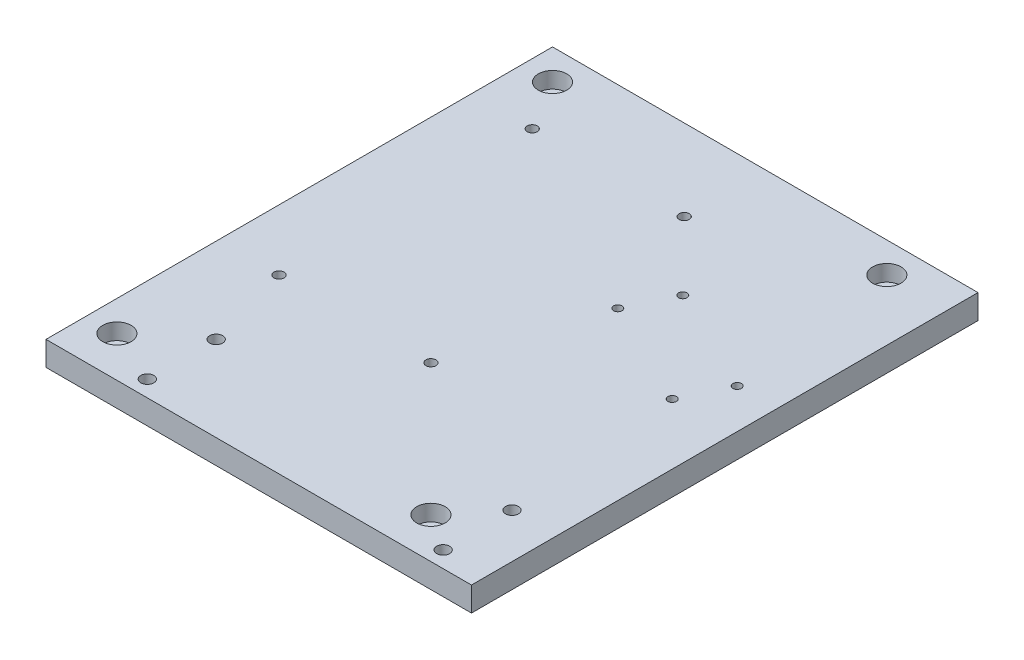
ISO-10303-21;
HEADER;
FILE_DESCRIPTION(('STEP AP214'),'2;1');
FILE_NAME('part.step','',(''),(''),'','','');
FILE_SCHEMA(('AUTOMOTIVE_DESIGN { 1 0 10303 214 1 1 1 1 }'));
ENDSEC;
DATA;
#1=APPLICATION_CONTEXT('core data for automotive mechanical design processes');
#2=APPLICATION_PROTOCOL_DEFINITION('international standard','automotive_design',2000,#1);
#3=PRODUCT_CONTEXT('',#1,'mechanical');
#4=PRODUCT('Part','Part','',(#3));
#5=PRODUCT_RELATED_PRODUCT_CATEGORY('part','',(#4));
#6=PRODUCT_DEFINITION_FORMATION('','',#4);
#7=PRODUCT_DEFINITION_CONTEXT('part definition',#1,'design');
#8=PRODUCT_DEFINITION('design','',#6,#7);
#9=PRODUCT_DEFINITION_SHAPE('','',#8);
#10=(LENGTH_UNIT() NAMED_UNIT(*) SI_UNIT(.MILLI.,.METRE.));
#11=(NAMED_UNIT(*) PLANE_ANGLE_UNIT() SI_UNIT($,.RADIAN.));
#12=(NAMED_UNIT(*) SI_UNIT($,.STERADIAN.) SOLID_ANGLE_UNIT());
#13=UNCERTAINTY_MEASURE_WITH_UNIT(LENGTH_MEASURE(1.E-05),#10,'distance_accuracy_value','');
#14=(GEOMETRIC_REPRESENTATION_CONTEXT(3) GLOBAL_UNCERTAINTY_ASSIGNED_CONTEXT((#13)) GLOBAL_UNIT_ASSIGNED_CONTEXT((#10,
#11,#12)) REPRESENTATION_CONTEXT('',''));
#15=CARTESIAN_POINT('',(0.,0.,0.));
#16=DIRECTION('',(0.,0.,1.));
#17=DIRECTION('',(1.,0.,0.));
#18=AXIS2_PLACEMENT_3D('',#15,#16,#17);
#19=CARTESIAN_POINT('',(-90.,4.,105.));
#20=DIRECTION('',(0.,1.,0.));
#21=DIRECTION('',(0.,0.,1.));
#22=AXIS2_PLACEMENT_3D('',#19,#20,#21);
#23=CYLINDRICAL_SURFACE('',#22,7.00000000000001);
#24=CARTESIAN_POINT('',(-90.,12.,105.));
#25=DIRECTION('',(0.,1.,0.));
#26=DIRECTION('',(0.,0.,1.));
#27=AXIS2_PLACEMENT_3D('',#24,#25,#26);
#28=CIRCLE('',#27,7.00000000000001);
#29=CARTESIAN_POINT('',(-90.,12.,112.));
#30=VERTEX_POINT('',#29);
#31=EDGE_CURVE('E199',#30,#30,#28,.F.);
#32=ORIENTED_EDGE('',*,*,#31,.F.);
#33=EDGE_LOOP('',(#32));
#34=FACE_BOUND('',#33,.T.);
#35=CARTESIAN_POINT('',(-90.,4.,105.));
#36=DIRECTION('',(0.,1.,0.));
#37=DIRECTION('',(0.,0.,1.));
#38=AXIS2_PLACEMENT_3D('',#35,#36,#37);
#39=CIRCLE('',#38,7.00000000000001);
#40=CARTESIAN_POINT('',(-90.,4.,112.));
#41=VERTEX_POINT('',#40);
#42=EDGE_CURVE('E219',#41,#41,#39,.T.);
#43=ORIENTED_EDGE('',*,*,#42,.F.);
#44=EDGE_LOOP('',(#43));
#45=FACE_BOUND('',#44,.T.);
#46=ADVANCED_FACE('F17',(#34,#45),#23,.F.);
#47=CARTESIAN_POINT('',(65.,4.,105.));
#48=DIRECTION('',(0.,1.,0.));
#49=DIRECTION('',(0.,0.,1.));
#50=AXIS2_PLACEMENT_3D('',#47,#48,#49);
#51=CYLINDRICAL_SURFACE('',#50,7.00000000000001);
#52=CARTESIAN_POINT('',(65.,12.,105.));
#53=DIRECTION('',(0.,1.,0.));
#54=DIRECTION('',(0.,0.,1.));
#55=AXIS2_PLACEMENT_3D('',#52,#53,#54);
#56=CIRCLE('',#55,7.00000000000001);
#57=CARTESIAN_POINT('',(65.,12.,112.));
#58=VERTEX_POINT('',#57);
#59=EDGE_CURVE('E196',#58,#58,#56,.F.);
#60=ORIENTED_EDGE('',*,*,#59,.F.);
#61=EDGE_LOOP('',(#60));
#62=FACE_BOUND('',#61,.T.);
#63=CARTESIAN_POINT('',(65.,4.,105.));
#64=DIRECTION('',(0.,1.,0.));
#65=DIRECTION('',(0.,0.,1.));
#66=AXIS2_PLACEMENT_3D('',#63,#64,#65);
#67=CIRCLE('',#66,7.00000000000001);
#68=CARTESIAN_POINT('',(65.,4.,112.));
#69=VERTEX_POINT('',#68);
#70=EDGE_CURVE('E217',#69,#69,#67,.T.);
#71=ORIENTED_EDGE('',*,*,#70,.F.);
#72=EDGE_LOOP('',(#71));
#73=FACE_BOUND('',#72,.T.);
#74=ADVANCED_FACE('F242',(#62,#73),#51,.F.);
#75=CARTESIAN_POINT('',(75.,4.,-110.));
#76=DIRECTION('',(0.,1.,0.));
#77=DIRECTION('',(0.,0.,1.));
#78=AXIS2_PLACEMENT_3D('',#75,#76,#77);
#79=CYLINDRICAL_SURFACE('',#78,7.00000000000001);
#80=CARTESIAN_POINT('',(75.,12.,-110.));
#81=DIRECTION('',(0.,1.,0.));
#82=DIRECTION('',(0.,0.,1.));
#83=AXIS2_PLACEMENT_3D('',#80,#81,#82);
#84=CIRCLE('',#83,7.00000000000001);
#85=CARTESIAN_POINT('',(75.,12.,-103.));
#86=VERTEX_POINT('',#85);
#87=EDGE_CURVE('E193',#86,#86,#84,.F.);
#88=ORIENTED_EDGE('',*,*,#87,.F.);
#89=EDGE_LOOP('',(#88));
#90=FACE_BOUND('',#89,.T.);
#91=CARTESIAN_POINT('',(75.,4.,-110.));
#92=DIRECTION('',(0.,1.,0.));
#93=DIRECTION('',(0.,0.,1.));
#94=AXIS2_PLACEMENT_3D('',#91,#92,#93);
#95=CIRCLE('',#94,7.00000000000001);
#96=CARTESIAN_POINT('',(75.,4.,-103.));
#97=VERTEX_POINT('',#96);
#98=EDGE_CURVE('E214',#97,#97,#95,.T.);
#99=ORIENTED_EDGE('',*,*,#98,.F.);
#100=EDGE_LOOP('',(#99));
#101=FACE_BOUND('',#100,.T.);
#102=ADVANCED_FACE('F231',(#90,#101),#79,.F.);
#103=CARTESIAN_POINT('',(-90.,4.,-110.));
#104=DIRECTION('',(0.,1.,0.));
#105=DIRECTION('',(0.,0.,1.));
#106=AXIS2_PLACEMENT_3D('',#103,#104,#105);
#107=CYLINDRICAL_SURFACE('',#106,7.00000000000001);
#108=CARTESIAN_POINT('',(-90.,12.,-110.));
#109=DIRECTION('',(0.,1.,0.));
#110=DIRECTION('',(0.,0.,1.));
#111=AXIS2_PLACEMENT_3D('',#108,#109,#110);
#112=CIRCLE('',#111,7.00000000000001);
#113=CARTESIAN_POINT('',(-90.,12.,-103.));
#114=VERTEX_POINT('',#113);
#115=EDGE_CURVE('E190',#114,#114,#112,.F.);
#116=ORIENTED_EDGE('',*,*,#115,.F.);
#117=EDGE_LOOP('',(#116));
#118=FACE_BOUND('',#117,.T.);
#119=CARTESIAN_POINT('',(-90.,4.,-110.));
#120=DIRECTION('',(0.,1.,0.));
#121=DIRECTION('',(0.,0.,1.));
#122=AXIS2_PLACEMENT_3D('',#119,#120,#121);
#123=CIRCLE('',#122,7.00000000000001);
#124=CARTESIAN_POINT('',(-90.,4.,-103.));
#125=VERTEX_POINT('',#124);
#126=EDGE_CURVE('E20',#125,#125,#123,.T.);
#127=ORIENTED_EDGE('',*,*,#126,.F.);
#128=EDGE_LOOP('',(#127));
#129=FACE_BOUND('',#128,.T.);
#130=ADVANCED_FACE('F228',(#118,#129),#107,.F.);
#131=CARTESIAN_POINT('',(-63.0000000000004,0.,116.999999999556));
#132=DIRECTION('',(0.,-1.,0.));
#133=DIRECTION('',(0.,0.,-1.));
#134=AXIS2_PLACEMENT_3D('',#131,#132,#133);
#135=CYLINDRICAL_SURFACE('',#134,3.19999999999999);
#136=CARTESIAN_POINT('',(-63.0000000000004,6.8,116.999999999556));
#137=DIRECTION('',(0.,-1.,0.));
#138=DIRECTION('',(0.,0.,-1.));
#139=AXIS2_PLACEMENT_3D('',#136,#137,#138);
#140=CIRCLE('',#139,3.19999999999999);
#141=CARTESIAN_POINT('',(-63.0000000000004,6.8,113.799999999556));
#142=VERTEX_POINT('',#141);
#143=EDGE_CURVE('E211',#142,#142,#140,.T.);
#144=ORIENTED_EDGE('',*,*,#143,.T.);
#145=EDGE_LOOP('',(#144));
#146=FACE_BOUND('',#145,.T.);
#147=CARTESIAN_POINT('',(-63.0000000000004,12.,116.999999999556));
#148=DIRECTION('',(0.,-1.,0.));
#149=DIRECTION('',(0.,0.,-1.));
#150=AXIS2_PLACEMENT_3D('',#147,#148,#149);
#151=CIRCLE('',#150,3.19999999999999);
#152=CARTESIAN_POINT('',(-63.0000000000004,12.,113.799999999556));
#153=VERTEX_POINT('',#152);
#154=EDGE_CURVE('E187',#153,#153,#151,.T.);
#155=ORIENTED_EDGE('',*,*,#154,.F.);
#156=EDGE_LOOP('',(#155));
#157=FACE_BOUND('',#156,.T.);
#158=ADVANCED_FACE('F230',(#146,#157),#135,.F.);
#159=CARTESIAN_POINT('',(-63.0000000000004,0.,82.9999999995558));
#160=DIRECTION('',(0.,-1.,0.));
#161=DIRECTION('',(0.,0.,-1.));
#162=AXIS2_PLACEMENT_3D('',#159,#160,#161);
#163=CYLINDRICAL_SURFACE('',#162,3.19999999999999);
#164=CARTESIAN_POINT('',(-63.0000000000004,6.8,82.9999999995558));
#165=DIRECTION('',(0.,-1.,0.));
#166=DIRECTION('',(0.,0.,-1.));
#167=AXIS2_PLACEMENT_3D('',#164,#165,#166);
#168=CIRCLE('',#167,3.19999999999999);
#169=CARTESIAN_POINT('',(-63.0000000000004,6.8,79.7999999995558));
#170=VERTEX_POINT('',#169);
#171=EDGE_CURVE('E208',#170,#170,#168,.T.);
#172=ORIENTED_EDGE('',*,*,#171,.T.);
#173=EDGE_LOOP('',(#172));
#174=FACE_BOUND('',#173,.T.);
#175=CARTESIAN_POINT('',(-63.0000000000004,12.,82.9999999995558));
#176=DIRECTION('',(0.,-1.,0.));
#177=DIRECTION('',(0.,0.,-1.));
#178=AXIS2_PLACEMENT_3D('',#175,#176,#177);
#179=CIRCLE('',#178,3.19999999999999);
#180=CARTESIAN_POINT('',(-63.0000000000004,12.,79.7999999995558));
#181=VERTEX_POINT('',#180);
#182=EDGE_CURVE('E184',#181,#181,#179,.T.);
#183=ORIENTED_EDGE('',*,*,#182,.F.);
#184=EDGE_LOOP('',(#183));
#185=FACE_BOUND('',#184,.T.);
#186=ADVANCED_FACE('F239',(#174,#185),#163,.F.);
#187=CARTESIAN_POINT('',(82.9999999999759,0.,117.000000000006));
#188=DIRECTION('',(0.,-1.,0.));
#189=DIRECTION('',(0.,0.,-1.));
#190=AXIS2_PLACEMENT_3D('',#187,#188,#189);
#191=CYLINDRICAL_SURFACE('',#190,3.19999999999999);
#192=CARTESIAN_POINT('',(82.9999999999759,6.8,117.000000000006));
#193=DIRECTION('',(0.,-1.,0.));
#194=DIRECTION('',(0.,0.,-1.));
#195=AXIS2_PLACEMENT_3D('',#192,#193,#194);
#196=CIRCLE('',#195,3.19999999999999);
#197=CARTESIAN_POINT('',(82.9999999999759,6.8,113.800000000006));
#198=VERTEX_POINT('',#197);
#199=EDGE_CURVE('E205',#198,#198,#196,.T.);
#200=ORIENTED_EDGE('',*,*,#199,.T.);
#201=EDGE_LOOP('',(#200));
#202=FACE_BOUND('',#201,.T.);
#203=CARTESIAN_POINT('',(82.9999999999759,12.,117.000000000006));
#204=DIRECTION('',(0.,-1.,0.));
#205=DIRECTION('',(0.,0.,-1.));
#206=AXIS2_PLACEMENT_3D('',#203,#204,#205);
#207=CIRCLE('',#206,3.19999999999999);
#208=CARTESIAN_POINT('',(82.9999999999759,12.,113.800000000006));
#209=VERTEX_POINT('',#208);
#210=EDGE_CURVE('E181',#209,#209,#207,.T.);
#211=ORIENTED_EDGE('',*,*,#210,.F.);
#212=EDGE_LOOP('',(#211));
#213=FACE_BOUND('',#212,.T.);
#214=ADVANCED_FACE('F366',(#202,#213),#191,.F.);
#215=CARTESIAN_POINT('',(82.9999999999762,0.,83.0000000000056));
#216=DIRECTION('',(0.,-1.,0.));
#217=DIRECTION('',(0.,0.,-1.));
#218=AXIS2_PLACEMENT_3D('',#215,#216,#217);
#219=CYLINDRICAL_SURFACE('',#218,3.19999999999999);
#220=CARTESIAN_POINT('',(82.9999999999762,6.8,83.0000000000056));
#221=DIRECTION('',(0.,-1.,0.));
#222=DIRECTION('',(0.,0.,-1.));
#223=AXIS2_PLACEMENT_3D('',#220,#221,#222);
#224=CIRCLE('',#223,3.19999999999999);
#225=CARTESIAN_POINT('',(82.9999999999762,6.8,79.8000000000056));
#226=VERTEX_POINT('',#225);
#227=EDGE_CURVE('E202',#226,#226,#224,.T.);
#228=ORIENTED_EDGE('',*,*,#227,.T.);
#229=EDGE_LOOP('',(#228));
#230=FACE_BOUND('',#229,.T.);
#231=CARTESIAN_POINT('',(82.9999999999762,12.,83.0000000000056));
#232=DIRECTION('',(0.,-1.,0.));
#233=DIRECTION('',(0.,0.,-1.));
#234=AXIS2_PLACEMENT_3D('',#231,#232,#233);
#235=CIRCLE('',#234,3.19999999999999);
#236=CARTESIAN_POINT('',(82.9999999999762,12.,79.8000000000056));
#237=VERTEX_POINT('',#236);
#238=EDGE_CURVE('E178',#237,#237,#235,.T.);
#239=ORIENTED_EDGE('',*,*,#238,.F.);
#240=EDGE_LOOP('',(#239));
#241=FACE_BOUND('',#240,.T.);
#242=ADVANCED_FACE('F362',(#230,#241),#219,.F.);
#243=CARTESIAN_POINT('',(-90.,4.,-110.));
#244=DIRECTION('',(0.,1.,0.));
#245=DIRECTION('',(0.,0.,1.));
#246=AXIS2_PLACEMENT_3D('',#243,#244,#245);
#247=PLANE('',#246);
#248=CARTESIAN_POINT('',(-90.,4.,-110.));
#249=DIRECTION('',(0.,1.,0.));
#250=DIRECTION('',(0.,0.,1.));
#251=AXIS2_PLACEMENT_3D('',#248,#249,#250);
#252=CIRCLE('',#251,4.25);
#253=CARTESIAN_POINT('',(-90.,4.,-105.75));
#254=VERTEX_POINT('',#253);
#255=EDGE_CURVE('E175',#254,#254,#252,.F.);
#256=ORIENTED_EDGE('',*,*,#255,.T.);
#257=EDGE_LOOP('',(#256));
#258=FACE_BOUND('',#257,.T.);
#259=ORIENTED_EDGE('',*,*,#126,.T.);
#260=EDGE_LOOP('',(#259));
#261=FACE_BOUND('',#260,.T.);
#262=ADVANCED_FACE('F226',(#258,#261),#247,.T.);
#263=CARTESIAN_POINT('',(-90.,4.,105.));
#264=DIRECTION('',(0.,1.,0.));
#265=DIRECTION('',(0.,0.,1.));
#266=AXIS2_PLACEMENT_3D('',#263,#264,#265);
#267=PLANE('',#266);
#268=CARTESIAN_POINT('',(-90.,4.,105.));
#269=DIRECTION('',(0.,1.,0.));
#270=DIRECTION('',(0.,0.,1.));
#271=AXIS2_PLACEMENT_3D('',#268,#269,#270);
#272=CIRCLE('',#271,4.25);
#273=CARTESIAN_POINT('',(-90.,4.,109.25));
#274=VERTEX_POINT('',#273);
#275=EDGE_CURVE('E172',#274,#274,#272,.F.);
#276=ORIENTED_EDGE('',*,*,#275,.T.);
#277=EDGE_LOOP('',(#276));
#278=FACE_BOUND('',#277,.T.);
#279=ORIENTED_EDGE('',*,*,#42,.T.);
#280=EDGE_LOOP('',(#279));
#281=FACE_BOUND('',#280,.T.);
#282=ADVANCED_FACE('F355',(#278,#281),#267,.T.);
#283=CARTESIAN_POINT('',(65.,4.,105.));
#284=DIRECTION('',(0.,1.,0.));
#285=DIRECTION('',(0.,0.,1.));
#286=AXIS2_PLACEMENT_3D('',#283,#284,#285);
#287=PLANE('',#286);
#288=CARTESIAN_POINT('',(65.,4.,105.));
#289=DIRECTION('',(0.,1.,0.));
#290=DIRECTION('',(0.,0.,1.));
#291=AXIS2_PLACEMENT_3D('',#288,#289,#290);
#292=CIRCLE('',#291,4.25);
#293=CARTESIAN_POINT('',(65.,4.,109.25));
#294=VERTEX_POINT('',#293);
#295=EDGE_CURVE('E169',#294,#294,#292,.F.);
#296=ORIENTED_EDGE('',*,*,#295,.T.);
#297=EDGE_LOOP('',(#296));
#298=FACE_BOUND('',#297,.T.);
#299=ORIENTED_EDGE('',*,*,#70,.T.);
#300=EDGE_LOOP('',(#299));
#301=FACE_BOUND('',#300,.T.);
#302=ADVANCED_FACE('F351',(#298,#301),#287,.T.);
#303=CARTESIAN_POINT('',(75.,4.,-110.));
#304=DIRECTION('',(0.,1.,0.));
#305=DIRECTION('',(0.,0.,1.));
#306=AXIS2_PLACEMENT_3D('',#303,#304,#305);
#307=PLANE('',#306);
#308=CARTESIAN_POINT('',(75.,4.,-110.));
#309=DIRECTION('',(0.,1.,0.));
#310=DIRECTION('',(0.,0.,1.));
#311=AXIS2_PLACEMENT_3D('',#308,#309,#310);
#312=CIRCLE('',#311,4.25);
#313=CARTESIAN_POINT('',(75.,4.,-105.75));
#314=VERTEX_POINT('',#313);
#315=EDGE_CURVE('E166',#314,#314,#312,.F.);
#316=ORIENTED_EDGE('',*,*,#315,.T.);
#317=EDGE_LOOP('',(#316));
#318=FACE_BOUND('',#317,.T.);
#319=ORIENTED_EDGE('',*,*,#98,.T.);
#320=EDGE_LOOP('',(#319));
#321=FACE_BOUND('',#320,.T.);
#322=ADVANCED_FACE('F347',(#318,#321),#307,.T.);
#323=CARTESIAN_POINT('',(-59.8000000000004,6.8,116.999999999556));
#324=DIRECTION('',(0.,1.,0.));
#325=DIRECTION('',(0.,0.,1.));
#326=AXIS2_PLACEMENT_3D('',#323,#324,#325);
#327=PLANE('',#326);
#328=CARTESIAN_POINT('',(-63.0000000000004,6.8,116.999999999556));
#329=DIRECTION('',(0.,-1.,0.));
#330=DIRECTION('',(0.,0.,-1.));
#331=AXIS2_PLACEMENT_3D('',#328,#329,#330);
#332=CIRCLE('',#331,5.50000000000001);
#333=CARTESIAN_POINT('',(-63.0000000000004,6.8,111.499999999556));
#334=VERTEX_POINT('',#333);
#335=EDGE_CURVE('E139',#334,#334,#332,.T.);
#336=ORIENTED_EDGE('',*,*,#335,.T.);
#337=EDGE_LOOP('',(#336));
#338=FACE_BOUND('',#337,.T.);
#339=ORIENTED_EDGE('',*,*,#143,.F.);
#340=EDGE_LOOP('',(#339));
#341=FACE_BOUND('',#340,.T.);
#342=ADVANCED_FACE('F343',(#338,#341),#327,.F.);
#343=CARTESIAN_POINT('',(-59.8000000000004,6.8,82.9999999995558));
#344=DIRECTION('',(0.,1.,0.));
#345=DIRECTION('',(0.,0.,1.));
#346=AXIS2_PLACEMENT_3D('',#343,#344,#345);
#347=PLANE('',#346);
#348=CARTESIAN_POINT('',(-63.0000000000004,6.8,82.9999999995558));
#349=DIRECTION('',(0.,-1.,0.));
#350=DIRECTION('',(0.,0.,-1.));
#351=AXIS2_PLACEMENT_3D('',#348,#349,#350);
#352=CIRCLE('',#351,5.50000000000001);
#353=CARTESIAN_POINT('',(-63.0000000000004,6.8,77.4999999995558));
#354=VERTEX_POINT('',#353);
#355=EDGE_CURVE('E136',#354,#354,#352,.T.);
#356=ORIENTED_EDGE('',*,*,#355,.T.);
#357=EDGE_LOOP('',(#356));
#358=FACE_BOUND('',#357,.T.);
#359=ORIENTED_EDGE('',*,*,#171,.F.);
#360=EDGE_LOOP('',(#359));
#361=FACE_BOUND('',#360,.T.);
#362=ADVANCED_FACE('F339',(#358,#361),#347,.F.);
#363=CARTESIAN_POINT('',(86.1999999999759,6.8,117.000000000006));
#364=DIRECTION('',(0.,1.,0.));
#365=DIRECTION('',(0.,0.,1.));
#366=AXIS2_PLACEMENT_3D('',#363,#364,#365);
#367=PLANE('',#366);
#368=CARTESIAN_POINT('',(82.9999999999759,6.8,117.000000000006));
#369=DIRECTION('',(0.,-1.,0.));
#370=DIRECTION('',(0.,0.,-1.));
#371=AXIS2_PLACEMENT_3D('',#368,#369,#370);
#372=CIRCLE('',#371,5.50000000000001);
#373=CARTESIAN_POINT('',(82.9999999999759,6.8,111.500000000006));
#374=VERTEX_POINT('',#373);
#375=EDGE_CURVE('E133',#374,#374,#372,.T.);
#376=ORIENTED_EDGE('',*,*,#375,.T.);
#377=EDGE_LOOP('',(#376));
#378=FACE_BOUND('',#377,.T.);
#379=ORIENTED_EDGE('',*,*,#199,.F.);
#380=EDGE_LOOP('',(#379));
#381=FACE_BOUND('',#380,.T.);
#382=ADVANCED_FACE('F335',(#378,#381),#367,.F.);
#383=CARTESIAN_POINT('',(86.1999999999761,6.8,83.0000000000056));
#384=DIRECTION('',(0.,1.,0.));
#385=DIRECTION('',(0.,0.,1.));
#386=AXIS2_PLACEMENT_3D('',#383,#384,#385);
#387=PLANE('',#386);
#388=CARTESIAN_POINT('',(82.9999999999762,6.8,83.0000000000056));
#389=DIRECTION('',(0.,-1.,0.));
#390=DIRECTION('',(0.,0.,-1.));
#391=AXIS2_PLACEMENT_3D('',#388,#389,#390);
#392=CIRCLE('',#391,5.50000000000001);
#393=CARTESIAN_POINT('',(82.9999999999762,6.8,77.5000000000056));
#394=VERTEX_POINT('',#393);
#395=EDGE_CURVE('E67',#394,#394,#392,.T.);
#396=ORIENTED_EDGE('',*,*,#395,.T.);
#397=EDGE_LOOP('',(#396));
#398=FACE_BOUND('',#397,.T.);
#399=ORIENTED_EDGE('',*,*,#227,.F.);
#400=EDGE_LOOP('',(#399));
#401=FACE_BOUND('',#400,.T.);
#402=ADVANCED_FACE('F332',(#398,#401),#387,.F.);
#403=CARTESIAN_POINT('',(0.,12.,0.));
#404=DIRECTION('',(0.,1.,0.));
#405=DIRECTION('',(0.,0.,1.));
#406=AXIS2_PLACEMENT_3D('',#403,#404,#405);
#407=PLANE('',#406);
#408=DIRECTION('',(0.,0.,-1.));
#409=VECTOR('',#408,1.);
#410=CARTESIAN_POINT('',(-105.,12.,-125.));
#411=LINE('',#410,#409);
#412=CARTESIAN_POINT('',(-105.,12.,-125.));
#413=VERTEX_POINT('',#412);
#414=CARTESIAN_POINT('',(-105.,12.,125.));
#415=VERTEX_POINT('',#414);
#416=EDGE_CURVE('E55',#413,#415,#411,.F.);
#417=ORIENTED_EDGE('',*,*,#416,.T.);
#418=DIRECTION('',(-1.,0.,0.));
#419=VECTOR('',#418,1.);
#420=CARTESIAN_POINT('',(-105.,12.,125.));
#421=LINE('',#420,#419);
#422=CARTESIAN_POINT('',(105.,12.,125.));
#423=VERTEX_POINT('',#422);
#424=EDGE_CURVE('E756',#415,#423,#421,.F.);
#425=ORIENTED_EDGE('',*,*,#424,.T.);
#426=DIRECTION('',(0.,0.,1.));
#427=VECTOR('',#426,1.);
#428=CARTESIAN_POINT('',(105.,12.,-125.));
#429=LINE('',#428,#427);
#430=CARTESIAN_POINT('',(105.,12.,-125.));
#431=VERTEX_POINT('',#430);
#432=EDGE_CURVE('E61',#423,#431,#429,.F.);
#433=ORIENTED_EDGE('',*,*,#432,.T.);
#434=DIRECTION('',(1.,0.,0.));
#435=VECTOR('',#434,1.);
#436=CARTESIAN_POINT('',(-105.,12.,-125.));
#437=LINE('',#436,#435);
#438=EDGE_CURVE('E58',#431,#413,#437,.F.);
#439=ORIENTED_EDGE('',*,*,#438,.T.);
#440=EDGE_LOOP('',(#417,#425,#433,#439));
#441=FACE_BOUND('',#440,.T.);
#442=ORIENTED_EDGE('',*,*,#238,.T.);
#443=EDGE_LOOP('',(#442));
#444=FACE_BOUND('',#443,.T.);
#445=ORIENTED_EDGE('',*,*,#210,.T.);
#446=EDGE_LOOP('',(#445));
#447=FACE_BOUND('',#446,.T.);
#448=ORIENTED_EDGE('',*,*,#182,.T.);
#449=EDGE_LOOP('',(#448));
#450=FACE_BOUND('',#449,.T.);
#451=ORIENTED_EDGE('',*,*,#154,.T.);
#452=EDGE_LOOP('',(#451));
#453=FACE_BOUND('',#452,.T.);
#454=CARTESIAN_POINT('',(75.0074574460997,12.,-4.04729389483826));
#455=DIRECTION('',(0.,1.,0.));
#456=DIRECTION('',(0.,0.,1.));
#457=AXIS2_PLACEMENT_3D('',#454,#455,#456);
#458=CIRCLE('',#457,2.09999999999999);
#459=CARTESIAN_POINT('',(75.0074574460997,12.,-1.94729389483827));
#460=VERTEX_POINT('',#459);
#461=EDGE_CURVE('E142',#460,#460,#458,.F.);
#462=ORIENTED_EDGE('',*,*,#461,.T.);
#463=EDGE_LOOP('',(#462));
#464=FACE_BOUND('',#463,.T.);
#465=CARTESIAN_POINT('',(85.4891263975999,12.,-25.637444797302));
#466=DIRECTION('',(0.,1.,0.));
#467=DIRECTION('',(0.,0.,1.));
#468=AXIS2_PLACEMENT_3D('',#465,#466,#467);
#469=CIRCLE('',#468,2.09999999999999);
#470=CARTESIAN_POINT('',(85.4891263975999,12.,-23.537444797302));
#471=VERTEX_POINT('',#470);
#472=EDGE_CURVE('E145',#471,#471,#469,.F.);
#473=ORIENTED_EDGE('',*,*,#472,.T.);
#474=EDGE_LOOP('',(#473));
#475=FACE_BOUND('',#474,.T.);
#476=CARTESIAN_POINT('',(22.8312594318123,12.,-29.3779938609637));
#477=DIRECTION('',(0.,1.,0.));
#478=DIRECTION('',(0.,0.,1.));
#479=AXIS2_PLACEMENT_3D('',#476,#477,#478);
#480=CIRCLE('',#479,2.09999999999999);
#481=CARTESIAN_POINT('',(22.8312594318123,12.,-27.2779938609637));
#482=VERTEX_POINT('',#481);
#483=EDGE_CURVE('E148',#482,#482,#480,.F.);
#484=ORIENTED_EDGE('',*,*,#483,.T.);
#485=EDGE_LOOP('',(#484));
#486=FACE_BOUND('',#485,.T.);
#487=CARTESIAN_POINT('',(33.3129283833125,12.,-50.9681447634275));
#488=DIRECTION('',(0.,1.,0.));
#489=DIRECTION('',(0.,0.,1.));
#490=AXIS2_PLACEMENT_3D('',#487,#488,#489);
#491=CIRCLE('',#490,2.09999999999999);
#492=CARTESIAN_POINT('',(33.3129283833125,12.,-48.8681447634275));
#493=VERTEX_POINT('',#492);
#494=EDGE_CURVE('E151',#493,#493,#491,.F.);
#495=ORIENTED_EDGE('',*,*,#494,.T.);
#496=EDGE_LOOP('',(#495));
#497=FACE_BOUND('',#496,.T.);
#498=CARTESIAN_POINT('',(-74.9999999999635,12.,39.9999999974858));
#499=DIRECTION('',(0.,1.,0.));
#500=DIRECTION('',(0.,0.,1.));
#501=AXIS2_PLACEMENT_3D('',#498,#499,#500);
#502=CIRCLE('',#501,2.5);
#503=CARTESIAN_POINT('',(-74.9999999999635,12.,42.4999999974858));
#504=VERTEX_POINT('',#503);
#505=EDGE_CURVE('E154',#504,#504,#502,.F.);
#506=ORIENTED_EDGE('',*,*,#505,.T.);
#507=EDGE_LOOP('',(#506));
#508=FACE_BOUND('',#507,.T.);
#509=CARTESIAN_POINT('',(3.64708263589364E-11,12.,39.9999999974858));
#510=DIRECTION('',(0.,1.,0.));
#511=DIRECTION('',(0.,0.,1.));
#512=AXIS2_PLACEMENT_3D('',#509,#510,#511);
#513=CIRCLE('',#512,2.5);
#514=CARTESIAN_POINT('',(3.64708263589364E-11,12.,42.4999999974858));
#515=VERTEX_POINT('',#514);
#516=EDGE_CURVE('E157',#515,#515,#513,.F.);
#517=ORIENTED_EDGE('',*,*,#516,.T.);
#518=EDGE_LOOP('',(#517));
#519=FACE_BOUND('',#518,.T.);
#520=CARTESIAN_POINT('',(-74.9999999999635,12.,-85.0000000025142));
#521=DIRECTION('',(0.,1.,0.));
#522=DIRECTION('',(0.,0.,1.));
#523=AXIS2_PLACEMENT_3D('',#520,#521,#522);
#524=CIRCLE('',#523,2.5);
#525=CARTESIAN_POINT('',(-74.9999999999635,12.,-82.5000000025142));
#526=VERTEX_POINT('',#525);
#527=EDGE_CURVE('E160',#526,#526,#524,.F.);
#528=ORIENTED_EDGE('',*,*,#527,.T.);
#529=EDGE_LOOP('',(#528));
#530=FACE_BOUND('',#529,.T.);
#531=CARTESIAN_POINT('',(3.64708263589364E-11,12.,-85.0000000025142));
#532=DIRECTION('',(0.,1.,0.));
#533=DIRECTION('',(0.,0.,1.));
#534=AXIS2_PLACEMENT_3D('',#531,#532,#533);
#535=CIRCLE('',#534,2.5);
#536=CARTESIAN_POINT('',(3.64708263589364E-11,12.,-82.5000000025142));
#537=VERTEX_POINT('',#536);
#538=EDGE_CURVE('E163',#537,#537,#535,.F.);
#539=ORIENTED_EDGE('',*,*,#538,.T.);
#540=EDGE_LOOP('',(#539));
#541=FACE_BOUND('',#540,.T.);
#542=ORIENTED_EDGE('',*,*,#115,.T.);
#543=EDGE_LOOP('',(#542));
#544=FACE_BOUND('',#543,.T.);
#545=ORIENTED_EDGE('',*,*,#87,.T.);
#546=EDGE_LOOP('',(#545));
#547=FACE_BOUND('',#546,.T.);
#548=ORIENTED_EDGE('',*,*,#59,.T.);
#549=EDGE_LOOP('',(#548));
#550=FACE_BOUND('',#549,.T.);
#551=ORIENTED_EDGE('',*,*,#31,.T.);
#552=EDGE_LOOP('',(#551));
#553=FACE_BOUND('',#552,.T.);
#554=ADVANCED_FACE('F59',(#441,#444,#447,#450,#453,#464,#475,#486,#497,#508,#519,#530,#541,#544,
#547,#550,#553),#407,.T.);
#555=CARTESIAN_POINT('',(-90.,0.,-110.));
#556=DIRECTION('',(0.,1.,0.));
#557=DIRECTION('',(0.,0.,1.));
#558=AXIS2_PLACEMENT_3D('',#555,#556,#557);
#559=CYLINDRICAL_SURFACE('',#558,4.25);
#560=CARTESIAN_POINT('',(-90.,0.,-110.));
#561=DIRECTION('',(0.,1.,0.));
#562=DIRECTION('',(0.,0.,1.));
#563=AXIS2_PLACEMENT_3D('',#560,#561,#562);
#564=CIRCLE('',#563,4.25);
#565=CARTESIAN_POINT('',(-90.,0.,-105.75));
#566=VERTEX_POINT('',#565);
#567=EDGE_CURVE('E127',#566,#566,#564,.F.);
#568=ORIENTED_EDGE('',*,*,#567,.T.);
#569=EDGE_LOOP('',(#568));
#570=FACE_BOUND('',#569,.T.);
#571=ORIENTED_EDGE('',*,*,#255,.F.);
#572=EDGE_LOOP('',(#571));
#573=FACE_BOUND('',#572,.T.);
#574=ADVANCED_FACE('F325',(#570,#573),#559,.F.);
#575=CARTESIAN_POINT('',(-90.,0.,105.));
#576=DIRECTION('',(0.,1.,0.));
#577=DIRECTION('',(0.,0.,1.));
#578=AXIS2_PLACEMENT_3D('',#575,#576,#577);
#579=CYLINDRICAL_SURFACE('',#578,4.25);
#580=CARTESIAN_POINT('',(-90.,0.,105.));
#581=DIRECTION('',(0.,1.,0.));
#582=DIRECTION('',(0.,0.,1.));
#583=AXIS2_PLACEMENT_3D('',#580,#581,#582);
#584=CIRCLE('',#583,4.25);
#585=CARTESIAN_POINT('',(-90.,0.,109.25));
#586=VERTEX_POINT('',#585);
#587=EDGE_CURVE('E124',#586,#586,#584,.F.);
#588=ORIENTED_EDGE('',*,*,#587,.T.);
#589=EDGE_LOOP('',(#588));
#590=FACE_BOUND('',#589,.T.);
#591=ORIENTED_EDGE('',*,*,#275,.F.);
#592=EDGE_LOOP('',(#591));
#593=FACE_BOUND('',#592,.T.);
#594=ADVANCED_FACE('F321',(#590,#593),#579,.F.);
#595=CARTESIAN_POINT('',(65.,0.,105.));
#596=DIRECTION('',(0.,1.,0.));
#597=DIRECTION('',(0.,0.,1.));
#598=AXIS2_PLACEMENT_3D('',#595,#596,#597);
#599=CYLINDRICAL_SURFACE('',#598,4.25);
#600=CARTESIAN_POINT('',(65.,0.,105.));
#601=DIRECTION('',(0.,1.,0.));
#602=DIRECTION('',(0.,0.,1.));
#603=AXIS2_PLACEMENT_3D('',#600,#601,#602);
#604=CIRCLE('',#603,4.25);
#605=CARTESIAN_POINT('',(65.,0.,109.25));
#606=VERTEX_POINT('',#605);
#607=EDGE_CURVE('E121',#606,#606,#604,.F.);
#608=ORIENTED_EDGE('',*,*,#607,.T.);
#609=EDGE_LOOP('',(#608));
#610=FACE_BOUND('',#609,.T.);
#611=ORIENTED_EDGE('',*,*,#295,.F.);
#612=EDGE_LOOP('',(#611));
#613=FACE_BOUND('',#612,.T.);
#614=ADVANCED_FACE('F317',(#610,#613),#599,.F.);
#615=CARTESIAN_POINT('',(75.,0.,-110.));
#616=DIRECTION('',(0.,1.,0.));
#617=DIRECTION('',(0.,0.,1.));
#618=AXIS2_PLACEMENT_3D('',#615,#616,#617);
#619=CYLINDRICAL_SURFACE('',#618,4.25);
#620=CARTESIAN_POINT('',(75.,0.,-110.));
#621=DIRECTION('',(0.,1.,0.));
#622=DIRECTION('',(0.,0.,1.));
#623=AXIS2_PLACEMENT_3D('',#620,#621,#622);
#624=CIRCLE('',#623,4.25);
#625=CARTESIAN_POINT('',(75.,0.,-105.75));
#626=VERTEX_POINT('',#625);
#627=EDGE_CURVE('E118',#626,#626,#624,.F.);
#628=ORIENTED_EDGE('',*,*,#627,.T.);
#629=EDGE_LOOP('',(#628));
#630=FACE_BOUND('',#629,.T.);
#631=ORIENTED_EDGE('',*,*,#315,.F.);
#632=EDGE_LOOP('',(#631));
#633=FACE_BOUND('',#632,.T.);
#634=ADVANCED_FACE('F313',(#630,#633),#619,.F.);
#635=CARTESIAN_POINT('',(3.64708263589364E-11,12.,-85.0000000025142));
#636=DIRECTION('',(0.,1.,0.));
#637=DIRECTION('',(0.,0.,1.));
#638=AXIS2_PLACEMENT_3D('',#635,#636,#637);
#639=CYLINDRICAL_SURFACE('',#638,2.5);
#640=CARTESIAN_POINT('',(3.64708263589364E-11,0.,-85.0000000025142));
#641=DIRECTION('',(0.,1.,0.));
#642=DIRECTION('',(0.,0.,1.));
#643=AXIS2_PLACEMENT_3D('',#640,#641,#642);
#644=CIRCLE('',#643,2.5);
#645=CARTESIAN_POINT('',(3.64708263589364E-11,0.,-82.5000000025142));
#646=VERTEX_POINT('',#645);
#647=EDGE_CURVE('E115',#646,#646,#644,.F.);
#648=ORIENTED_EDGE('',*,*,#647,.T.);
#649=EDGE_LOOP('',(#648));
#650=FACE_BOUND('',#649,.T.);
#651=ORIENTED_EDGE('',*,*,#538,.F.);
#652=EDGE_LOOP('',(#651));
#653=FACE_BOUND('',#652,.T.);
#654=ADVANCED_FACE('F309',(#650,#653),#639,.F.);
#655=CARTESIAN_POINT('',(-74.9999999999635,12.,-85.0000000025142));
#656=DIRECTION('',(0.,1.,0.));
#657=DIRECTION('',(0.,0.,1.));
#658=AXIS2_PLACEMENT_3D('',#655,#656,#657);
#659=CYLINDRICAL_SURFACE('',#658,2.5);
#660=CARTESIAN_POINT('',(-74.9999999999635,0.,-85.0000000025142));
#661=DIRECTION('',(0.,1.,0.));
#662=DIRECTION('',(0.,0.,1.));
#663=AXIS2_PLACEMENT_3D('',#660,#661,#662);
#664=CIRCLE('',#663,2.5);
#665=CARTESIAN_POINT('',(-74.9999999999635,0.,-82.5000000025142));
#666=VERTEX_POINT('',#665);
#667=EDGE_CURVE('E112',#666,#666,#664,.F.);
#668=ORIENTED_EDGE('',*,*,#667,.T.);
#669=EDGE_LOOP('',(#668));
#670=FACE_BOUND('',#669,.T.);
#671=ORIENTED_EDGE('',*,*,#527,.F.);
#672=EDGE_LOOP('',(#671));
#673=FACE_BOUND('',#672,.T.);
#674=ADVANCED_FACE('F305',(#670,#673),#659,.F.);
#675=CARTESIAN_POINT('',(3.64708263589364E-11,12.,39.9999999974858));
#676=DIRECTION('',(0.,1.,0.));
#677=DIRECTION('',(0.,0.,1.));
#678=AXIS2_PLACEMENT_3D('',#675,#676,#677);
#679=CYLINDRICAL_SURFACE('',#678,2.5);
#680=CARTESIAN_POINT('',(3.64708263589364E-11,0.,39.9999999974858));
#681=DIRECTION('',(0.,1.,0.));
#682=DIRECTION('',(0.,0.,1.));
#683=AXIS2_PLACEMENT_3D('',#680,#681,#682);
#684=CIRCLE('',#683,2.5);
#685=CARTESIAN_POINT('',(3.64708263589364E-11,0.,42.4999999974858));
#686=VERTEX_POINT('',#685);
#687=EDGE_CURVE('E109',#686,#686,#684,.F.);
#688=ORIENTED_EDGE('',*,*,#687,.T.);
#689=EDGE_LOOP('',(#688));
#690=FACE_BOUND('',#689,.T.);
#691=ORIENTED_EDGE('',*,*,#516,.F.);
#692=EDGE_LOOP('',(#691));
#693=FACE_BOUND('',#692,.T.);
#694=ADVANCED_FACE('F301',(#690,#693),#679,.F.);
#695=CARTESIAN_POINT('',(-74.9999999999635,12.,39.9999999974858));
#696=DIRECTION('',(0.,1.,0.));
#697=DIRECTION('',(0.,0.,1.));
#698=AXIS2_PLACEMENT_3D('',#695,#696,#697);
#699=CYLINDRICAL_SURFACE('',#698,2.5);
#700=CARTESIAN_POINT('',(-74.9999999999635,0.,39.9999999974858));
#701=DIRECTION('',(0.,1.,0.));
#702=DIRECTION('',(0.,0.,1.));
#703=AXIS2_PLACEMENT_3D('',#700,#701,#702);
#704=CIRCLE('',#703,2.5);
#705=CARTESIAN_POINT('',(-74.9999999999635,0.,42.4999999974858));
#706=VERTEX_POINT('',#705);
#707=EDGE_CURVE('E106',#706,#706,#704,.F.);
#708=ORIENTED_EDGE('',*,*,#707,.T.);
#709=EDGE_LOOP('',(#708));
#710=FACE_BOUND('',#709,.T.);
#711=ORIENTED_EDGE('',*,*,#505,.F.);
#712=EDGE_LOOP('',(#711));
#713=FACE_BOUND('',#712,.T.);
#714=ADVANCED_FACE('F297',(#710,#713),#699,.F.);
#715=CARTESIAN_POINT('',(33.3129283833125,12.,-50.9681447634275));
#716=DIRECTION('',(0.,1.,0.));
#717=DIRECTION('',(0.,0.,1.));
#718=AXIS2_PLACEMENT_3D('',#715,#716,#717);
#719=CYLINDRICAL_SURFACE('',#718,2.09999999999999);
#720=CARTESIAN_POINT('',(33.3129283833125,0.,-50.9681447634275));
#721=DIRECTION('',(0.,1.,0.));
#722=DIRECTION('',(0.,0.,1.));
#723=AXIS2_PLACEMENT_3D('',#720,#721,#722);
#724=CIRCLE('',#723,2.09999999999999);
#725=CARTESIAN_POINT('',(33.3129283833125,0.,-48.8681447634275));
#726=VERTEX_POINT('',#725);
#727=EDGE_CURVE('E103',#726,#726,#724,.F.);
#728=ORIENTED_EDGE('',*,*,#727,.T.);
#729=EDGE_LOOP('',(#728));
#730=FACE_BOUND('',#729,.T.);
#731=ORIENTED_EDGE('',*,*,#494,.F.);
#732=EDGE_LOOP('',(#731));
#733=FACE_BOUND('',#732,.T.);
#734=ADVANCED_FACE('F293',(#730,#733),#719,.F.);
#735=CARTESIAN_POINT('',(22.8312594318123,12.,-29.3779938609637));
#736=DIRECTION('',(0.,1.,0.));
#737=DIRECTION('',(0.,0.,1.));
#738=AXIS2_PLACEMENT_3D('',#735,#736,#737);
#739=CYLINDRICAL_SURFACE('',#738,2.09999999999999);
#740=CARTESIAN_POINT('',(22.8312594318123,0.,-29.3779938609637));
#741=DIRECTION('',(0.,1.,0.));
#742=DIRECTION('',(0.,0.,1.));
#743=AXIS2_PLACEMENT_3D('',#740,#741,#742);
#744=CIRCLE('',#743,2.09999999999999);
#745=CARTESIAN_POINT('',(22.8312594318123,0.,-27.2779938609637));
#746=VERTEX_POINT('',#745);
#747=EDGE_CURVE('E100',#746,#746,#744,.F.);
#748=ORIENTED_EDGE('',*,*,#747,.T.);
#749=EDGE_LOOP('',(#748));
#750=FACE_BOUND('',#749,.T.);
#751=ORIENTED_EDGE('',*,*,#483,.F.);
#752=EDGE_LOOP('',(#751));
#753=FACE_BOUND('',#752,.T.);
#754=ADVANCED_FACE('F289',(#750,#753),#739,.F.);
#755=CARTESIAN_POINT('',(85.4891263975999,12.,-25.637444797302));
#756=DIRECTION('',(0.,1.,0.));
#757=DIRECTION('',(0.,0.,1.));
#758=AXIS2_PLACEMENT_3D('',#755,#756,#757);
#759=CYLINDRICAL_SURFACE('',#758,2.09999999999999);
#760=CARTESIAN_POINT('',(85.4891263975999,0.,-25.637444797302));
#761=DIRECTION('',(0.,1.,0.));
#762=DIRECTION('',(0.,0.,1.));
#763=AXIS2_PLACEMENT_3D('',#760,#761,#762);
#764=CIRCLE('',#763,2.09999999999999);
#765=CARTESIAN_POINT('',(85.4891263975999,0.,-23.537444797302));
#766=VERTEX_POINT('',#765);
#767=EDGE_CURVE('E97',#766,#766,#764,.F.);
#768=ORIENTED_EDGE('',*,*,#767,.T.);
#769=EDGE_LOOP('',(#768));
#770=FACE_BOUND('',#769,.T.);
#771=ORIENTED_EDGE('',*,*,#472,.F.);
#772=EDGE_LOOP('',(#771));
#773=FACE_BOUND('',#772,.T.);
#774=ADVANCED_FACE('F285',(#770,#773),#759,.F.);
#775=CARTESIAN_POINT('',(75.0074574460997,12.,-4.04729389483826));
#776=DIRECTION('',(0.,1.,0.));
#777=DIRECTION('',(0.,0.,1.));
#778=AXIS2_PLACEMENT_3D('',#775,#776,#777);
#779=CYLINDRICAL_SURFACE('',#778,2.09999999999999);
#780=CARTESIAN_POINT('',(75.0074574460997,0.,-4.04729389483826));
#781=DIRECTION('',(0.,1.,0.));
#782=DIRECTION('',(0.,0.,1.));
#783=AXIS2_PLACEMENT_3D('',#780,#781,#782);
#784=CIRCLE('',#783,2.09999999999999);
#785=CARTESIAN_POINT('',(75.0074574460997,0.,-1.94729389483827));
#786=VERTEX_POINT('',#785);
#787=EDGE_CURVE('E94',#786,#786,#784,.F.);
#788=ORIENTED_EDGE('',*,*,#787,.T.);
#789=EDGE_LOOP('',(#788));
#790=FACE_BOUND('',#789,.T.);
#791=ORIENTED_EDGE('',*,*,#461,.F.);
#792=EDGE_LOOP('',(#791));
#793=FACE_BOUND('',#792,.T.);
#794=ADVANCED_FACE('F281',(#790,#793),#779,.F.);
#795=CARTESIAN_POINT('',(-63.0000000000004,0.,116.999999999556));
#796=DIRECTION('',(0.,-1.,0.));
#797=DIRECTION('',(0.,0.,-1.));
#798=AXIS2_PLACEMENT_3D('',#795,#796,#797);
#799=CYLINDRICAL_SURFACE('',#798,5.50000000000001);
#800=ORIENTED_EDGE('',*,*,#335,.F.);
#801=EDGE_LOOP('',(#800));
#802=FACE_BOUND('',#801,.T.);
#803=CARTESIAN_POINT('',(-63.0000000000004,0.,116.999999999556));
#804=DIRECTION('',(0.,-1.,0.));
#805=DIRECTION('',(0.,0.,-1.));
#806=AXIS2_PLACEMENT_3D('',#803,#804,#805);
#807=CIRCLE('',#806,5.50000000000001);
#808=CARTESIAN_POINT('',(-63.0000000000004,0.,111.499999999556));
#809=VERTEX_POINT('',#808);
#810=EDGE_CURVE('E91',#809,#809,#807,.T.);
#811=ORIENTED_EDGE('',*,*,#810,.T.);
#812=EDGE_LOOP('',(#811));
#813=FACE_BOUND('',#812,.T.);
#814=ADVANCED_FACE('F277',(#802,#813),#799,.F.);
#815=CARTESIAN_POINT('',(-63.0000000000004,0.,82.9999999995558));
#816=DIRECTION('',(0.,-1.,0.));
#817=DIRECTION('',(0.,0.,-1.));
#818=AXIS2_PLACEMENT_3D('',#815,#816,#817);
#819=CYLINDRICAL_SURFACE('',#818,5.50000000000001);
#820=ORIENTED_EDGE('',*,*,#355,.F.);
#821=EDGE_LOOP('',(#820));
#822=FACE_BOUND('',#821,.T.);
#823=CARTESIAN_POINT('',(-63.0000000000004,0.,82.9999999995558));
#824=DIRECTION('',(0.,-1.,0.));
#825=DIRECTION('',(0.,0.,-1.));
#826=AXIS2_PLACEMENT_3D('',#823,#824,#825);
#827=CIRCLE('',#826,5.50000000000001);
#828=CARTESIAN_POINT('',(-63.0000000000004,0.,77.4999999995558));
#829=VERTEX_POINT('',#828);
#830=EDGE_CURVE('E88',#829,#829,#827,.T.);
#831=ORIENTED_EDGE('',*,*,#830,.T.);
#832=EDGE_LOOP('',(#831));
#833=FACE_BOUND('',#832,.T.);
#834=ADVANCED_FACE('F273',(#822,#833),#819,.F.);
#835=CARTESIAN_POINT('',(82.9999999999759,0.,117.000000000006));
#836=DIRECTION('',(0.,-1.,0.));
#837=DIRECTION('',(0.,0.,-1.));
#838=AXIS2_PLACEMENT_3D('',#835,#836,#837);
#839=CYLINDRICAL_SURFACE('',#838,5.50000000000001);
#840=ORIENTED_EDGE('',*,*,#375,.F.);
#841=EDGE_LOOP('',(#840));
#842=FACE_BOUND('',#841,.T.);
#843=CARTESIAN_POINT('',(82.9999999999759,0.,117.000000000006));
#844=DIRECTION('',(0.,-1.,0.));
#845=DIRECTION('',(0.,0.,-1.));
#846=AXIS2_PLACEMENT_3D('',#843,#844,#845);
#847=CIRCLE('',#846,5.50000000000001);
#848=CARTESIAN_POINT('',(82.9999999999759,0.,111.500000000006));
#849=VERTEX_POINT('',#848);
#850=EDGE_CURVE('E85',#849,#849,#847,.T.);
#851=ORIENTED_EDGE('',*,*,#850,.T.);
#852=EDGE_LOOP('',(#851));
#853=FACE_BOUND('',#852,.T.);
#854=ADVANCED_FACE('F269',(#842,#853),#839,.F.);
#855=CARTESIAN_POINT('',(82.9999999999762,0.,83.0000000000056));
#856=DIRECTION('',(0.,-1.,0.));
#857=DIRECTION('',(0.,0.,-1.));
#858=AXIS2_PLACEMENT_3D('',#855,#856,#857);
#859=CYLINDRICAL_SURFACE('',#858,5.50000000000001);
#860=ORIENTED_EDGE('',*,*,#395,.F.);
#861=EDGE_LOOP('',(#860));
#862=FACE_BOUND('',#861,.T.);
#863=CARTESIAN_POINT('',(82.9999999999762,0.,83.0000000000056));
#864=DIRECTION('',(0.,-1.,0.));
#865=DIRECTION('',(0.,0.,-1.));
#866=AXIS2_PLACEMENT_3D('',#863,#864,#865);
#867=CIRCLE('',#866,5.50000000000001);
#868=CARTESIAN_POINT('',(82.9999999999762,0.,77.5000000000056));
#869=VERTEX_POINT('',#868);
#870=EDGE_CURVE('E82',#869,#869,#867,.T.);
#871=ORIENTED_EDGE('',*,*,#870,.T.);
#872=EDGE_LOOP('',(#871));
#873=FACE_BOUND('',#872,.T.);
#874=ADVANCED_FACE('F266',(#862,#873),#859,.F.);
#875=CARTESIAN_POINT('',(-105.,12.,-125.));
#876=DIRECTION('',(0.,0.,1.));
#877=DIRECTION('',(1.,0.,0.));
#878=AXIS2_PLACEMENT_3D('',#875,#876,#877);
#879=PLANE('',#878);
#880=DIRECTION('',(0.,1.,0.));
#881=VECTOR('',#880,1.);
#882=CARTESIAN_POINT('',(-105.,12.,-125.));
#883=LINE('',#882,#881);
#884=CARTESIAN_POINT('',(-105.,0.,-125.));
#885=VERTEX_POINT('',#884);
#886=EDGE_CURVE('E66',#885,#413,#883,.T.);
#887=ORIENTED_EDGE('',*,*,#886,.T.);
#888=ORIENTED_EDGE('',*,*,#438,.F.);
#889=DIRECTION('',(0.,1.,0.));
#890=VECTOR('',#889,1.);
#891=CARTESIAN_POINT('',(105.,12.,-125.));
#892=LINE('',#891,#890);
#893=CARTESIAN_POINT('',(105.,0.,-125.));
#894=VERTEX_POINT('',#893);
#895=EDGE_CURVE('E130',#431,#894,#892,.F.);
#896=ORIENTED_EDGE('',*,*,#895,.T.);
#897=DIRECTION('',(1.,0.,0.));
#898=VECTOR('',#897,1.);
#899=CARTESIAN_POINT('',(0.,0.,-125.));
#900=LINE('',#899,#898);
#901=EDGE_CURVE('E78',#894,#885,#900,.F.);
#902=ORIENTED_EDGE('',*,*,#901,.T.);
#903=EDGE_LOOP('',(#887,#888,#896,#902));
#904=FACE_BOUND('',#903,.T.);
#905=ADVANCED_FACE('F77',(#904),#879,.F.);
#906=CARTESIAN_POINT('',(-105.,12.,-125.));
#907=DIRECTION('',(1.,0.,0.));
#908=DIRECTION('',(0.,0.,-1.));
#909=AXIS2_PLACEMENT_3D('',#906,#907,#908);
#910=PLANE('',#909);
#911=DIRECTION('',(0.,1.,0.));
#912=VECTOR('',#911,1.);
#913=CARTESIAN_POINT('',(-105.,12.,125.));
#914=LINE('',#913,#912);
#915=CARTESIAN_POINT('',(-105.,0.,125.));
#916=VERTEX_POINT('',#915);
#917=EDGE_CURVE('E74',#916,#415,#914,.T.);
#918=ORIENTED_EDGE('',*,*,#917,.T.);
#919=ORIENTED_EDGE('',*,*,#416,.F.);
#920=ORIENTED_EDGE('',*,*,#886,.F.);
#921=DIRECTION('',(0.,0.,1.));
#922=VECTOR('',#921,1.);
#923=CARTESIAN_POINT('',(-105.,0.,0.));
#924=LINE('',#923,#922);
#925=EDGE_CURVE('E763',#885,#916,#924,.T.);
#926=ORIENTED_EDGE('',*,*,#925,.T.);
#927=EDGE_LOOP('',(#918,#919,#920,#926));
#928=FACE_BOUND('',#927,.T.);
#929=ADVANCED_FACE('F71',(#928),#910,.F.);
#930=CARTESIAN_POINT('',(-105.,12.,125.));
#931=DIRECTION('',(0.,0.,-1.));
#932=DIRECTION('',(-1.,0.,0.));
#933=AXIS2_PLACEMENT_3D('',#930,#931,#932);
#934=PLANE('',#933);
#935=DIRECTION('',(0.,1.,0.));
#936=VECTOR('',#935,1.);
#937=CARTESIAN_POINT('',(105.,12.,125.));
#938=LINE('',#937,#936);
#939=CARTESIAN_POINT('',(105.,0.,125.));
#940=VERTEX_POINT('',#939);
#941=EDGE_CURVE('E34',#940,#423,#938,.T.);
#942=ORIENTED_EDGE('',*,*,#941,.T.);
#943=ORIENTED_EDGE('',*,*,#424,.F.);
#944=ORIENTED_EDGE('',*,*,#917,.F.);
#945=DIRECTION('',(1.,0.,0.));
#946=VECTOR('',#945,1.);
#947=CARTESIAN_POINT('',(0.,0.,125.));
#948=LINE('',#947,#946);
#949=EDGE_CURVE('E26',#916,#940,#948,.T.);
#950=ORIENTED_EDGE('',*,*,#949,.T.);
#951=EDGE_LOOP('',(#942,#943,#944,#950));
#952=FACE_BOUND('',#951,.T.);
#953=ADVANCED_FACE('F254',(#952),#934,.F.);
#954=CARTESIAN_POINT('',(105.,12.,-125.));
#955=DIRECTION('',(-1.,0.,0.));
#956=DIRECTION('',(0.,0.,1.));
#957=AXIS2_PLACEMENT_3D('',#954,#955,#956);
#958=PLANE('',#957);
#959=ORIENTED_EDGE('',*,*,#895,.F.);
#960=ORIENTED_EDGE('',*,*,#432,.F.);
#961=ORIENTED_EDGE('',*,*,#941,.F.);
#962=DIRECTION('',(0.,0.,1.));
#963=VECTOR('',#962,1.);
#964=CARTESIAN_POINT('',(105.,0.,0.));
#965=LINE('',#964,#963);
#966=EDGE_CURVE('E11',#940,#894,#965,.F.);
#967=ORIENTED_EDGE('',*,*,#966,.T.);
#968=EDGE_LOOP('',(#959,#960,#961,#967));
#969=FACE_BOUND('',#968,.T.);
#970=ADVANCED_FACE('F248',(#969),#958,.F.);
#971=CARTESIAN_POINT('',(0.,0.,0.));
#972=DIRECTION('',(0.,1.,0.));
#973=DIRECTION('',(0.,0.,1.));
#974=AXIS2_PLACEMENT_3D('',#971,#972,#973);
#975=PLANE('',#974);
#976=ORIENTED_EDGE('',*,*,#949,.F.);
#977=ORIENTED_EDGE('',*,*,#925,.F.);
#978=ORIENTED_EDGE('',*,*,#901,.F.);
#979=ORIENTED_EDGE('',*,*,#966,.F.);
#980=EDGE_LOOP('',(#976,#977,#978,#979));
#981=FACE_BOUND('',#980,.T.);
#982=ORIENTED_EDGE('',*,*,#870,.F.);
#983=EDGE_LOOP('',(#982));
#984=FACE_BOUND('',#983,.T.);
#985=ORIENTED_EDGE('',*,*,#850,.F.);
#986=EDGE_LOOP('',(#985));
#987=FACE_BOUND('',#986,.T.);
#988=ORIENTED_EDGE('',*,*,#830,.F.);
#989=EDGE_LOOP('',(#988));
#990=FACE_BOUND('',#989,.T.);
#991=ORIENTED_EDGE('',*,*,#810,.F.);
#992=EDGE_LOOP('',(#991));
#993=FACE_BOUND('',#992,.T.);
#994=ORIENTED_EDGE('',*,*,#787,.F.);
#995=EDGE_LOOP('',(#994));
#996=FACE_BOUND('',#995,.T.);
#997=ORIENTED_EDGE('',*,*,#767,.F.);
#998=EDGE_LOOP('',(#997));
#999=FACE_BOUND('',#998,.T.);
#1000=ORIENTED_EDGE('',*,*,#747,.F.);
#1001=EDGE_LOOP('',(#1000));
#1002=FACE_BOUND('',#1001,.T.);
#1003=ORIENTED_EDGE('',*,*,#727,.F.);
#1004=EDGE_LOOP('',(#1003));
#1005=FACE_BOUND('',#1004,.T.);
#1006=ORIENTED_EDGE('',*,*,#707,.F.);
#1007=EDGE_LOOP('',(#1006));
#1008=FACE_BOUND('',#1007,.T.);
#1009=ORIENTED_EDGE('',*,*,#687,.F.);
#1010=EDGE_LOOP('',(#1009));
#1011=FACE_BOUND('',#1010,.T.);
#1012=ORIENTED_EDGE('',*,*,#667,.F.);
#1013=EDGE_LOOP('',(#1012));
#1014=FACE_BOUND('',#1013,.T.);
#1015=ORIENTED_EDGE('',*,*,#647,.F.);
#1016=EDGE_LOOP('',(#1015));
#1017=FACE_BOUND('',#1016,.T.);
#1018=ORIENTED_EDGE('',*,*,#627,.F.);
#1019=EDGE_LOOP('',(#1018));
#1020=FACE_BOUND('',#1019,.T.);
#1021=ORIENTED_EDGE('',*,*,#607,.F.);
#1022=EDGE_LOOP('',(#1021));
#1023=FACE_BOUND('',#1022,.T.);
#1024=ORIENTED_EDGE('',*,*,#587,.F.);
#1025=EDGE_LOOP('',(#1024));
#1026=FACE_BOUND('',#1025,.T.);
#1027=ORIENTED_EDGE('',*,*,#567,.F.);
#1028=EDGE_LOOP('',(#1027));
#1029=FACE_BOUND('',#1028,.T.);
#1030=ADVANCED_FACE('F246',(#981,#984,#987,#990,#993,#996,#999,#1002,#1005,#1008,#1011,#1014,
#1017,#1020,#1023,#1026,#1029),#975,.F.);
#1031=CLOSED_SHELL('',(#46,#74,#102,#130,#158,#186,#214,#242,#262,#282,#302,#322,#342,#362,#382,
#402,#554,#574,#594,#614,#634,#654,#674,#694,#714,#734,#754,#774,#794,#814,#834,#854,#874,#905,
#929,#953,#970,#1030));
#1032=MANIFOLD_SOLID_BREP('B1',#1031);
#1033=ADVANCED_BREP_SHAPE_REPRESENTATION('',(#18,#1032),#14);
#1034=SHAPE_DEFINITION_REPRESENTATION(#9,#1033);
ENDSEC;
END-ISO-10303-21;
